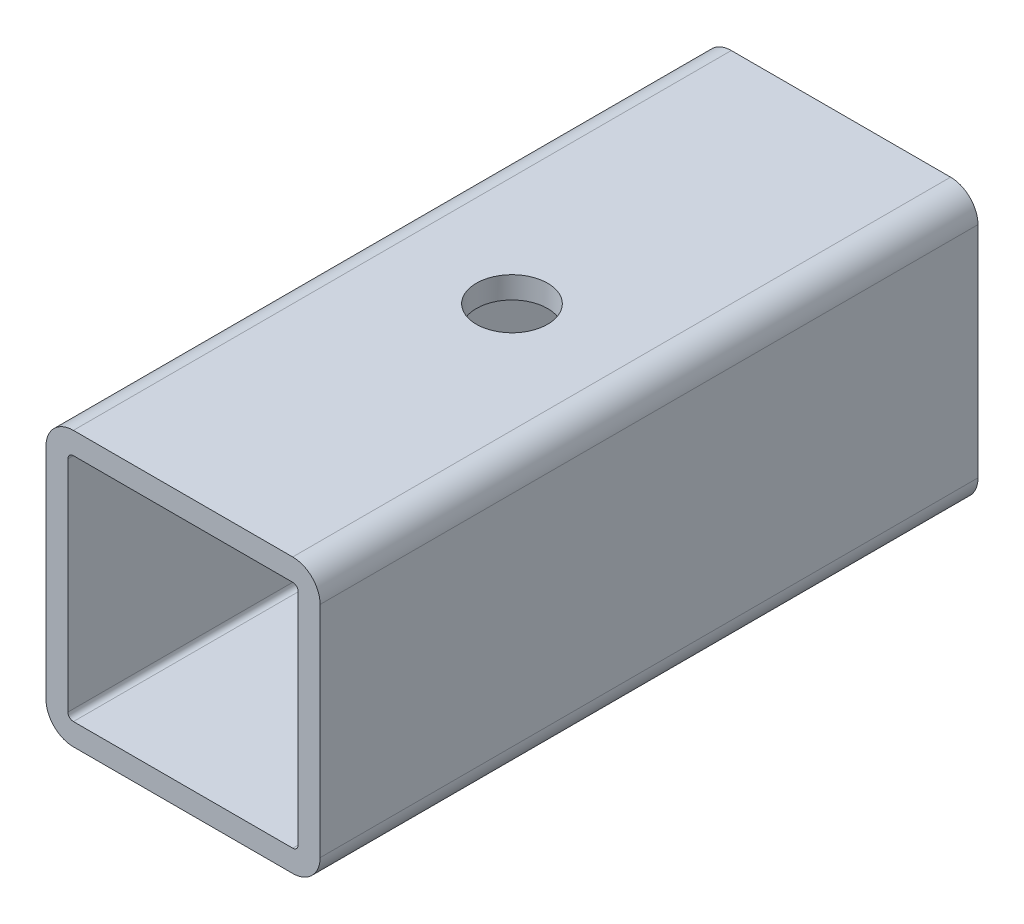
ISO-10303-21;
HEADER;
FILE_DESCRIPTION(('STEP AP214'),'2;1');
FILE_NAME('part.step','',(''),(''),'','','');
FILE_SCHEMA(('AUTOMOTIVE_DESIGN { 1 0 10303 214 1 1 1 1 }'));
ENDSEC;
DATA;
#1=APPLICATION_CONTEXT('core data for automotive mechanical design processes');
#2=APPLICATION_PROTOCOL_DEFINITION('international standard','automotive_design',2000,#1);
#3=PRODUCT_CONTEXT('',#1,'mechanical');
#4=PRODUCT('Part','Part','',(#3));
#5=PRODUCT_RELATED_PRODUCT_CATEGORY('part','',(#4));
#6=PRODUCT_DEFINITION_FORMATION('','',#4);
#7=PRODUCT_DEFINITION_CONTEXT('part definition',#1,'design');
#8=PRODUCT_DEFINITION('design','',#6,#7);
#9=PRODUCT_DEFINITION_SHAPE('','',#8);
#10=(LENGTH_UNIT() NAMED_UNIT(*) SI_UNIT(.MILLI.,.METRE.));
#11=(NAMED_UNIT(*) PLANE_ANGLE_UNIT() SI_UNIT($,.RADIAN.));
#12=(NAMED_UNIT(*) SI_UNIT($,.STERADIAN.) SOLID_ANGLE_UNIT());
#13=UNCERTAINTY_MEASURE_WITH_UNIT(LENGTH_MEASURE(1.E-05),#10,'distance_accuracy_value','');
#14=(GEOMETRIC_REPRESENTATION_CONTEXT(3) GLOBAL_UNCERTAINTY_ASSIGNED_CONTEXT((#13)) GLOBAL_UNIT_ASSIGNED_CONTEXT((#10,
#11,#12)) REPRESENTATION_CONTEXT('',''));
#15=CARTESIAN_POINT('',(0.,0.,0.));
#16=DIRECTION('',(0.,0.,1.));
#17=DIRECTION('',(1.,0.,0.));
#18=AXIS2_PLACEMENT_3D('',#15,#16,#17);
#19=CARTESIAN_POINT('',(45.,-5.,120.));
#20=DIRECTION('',(0.,0.,1.));
#21=DIRECTION('',(1.,0.,0.));
#22=AXIS2_PLACEMENT_3D('',#19,#20,#21);
#23=PLANE('',#22);
#24=CARTESIAN_POINT('',(45.,-5.,120.));
#25=DIRECTION('',(0.,0.,1.));
#26=DIRECTION('',(1.,0.,0.));
#27=AXIS2_PLACEMENT_3D('',#24,#25,#26);
#28=CIRCLE('',#27,5.);
#29=CARTESIAN_POINT('',(50.,-5.00000000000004,120.));
#30=VERTEX_POINT('',#29);
#31=CARTESIAN_POINT('',(45.,0.,120.));
#32=VERTEX_POINT('',#31);
#33=EDGE_CURVE('E228',#30,#32,#28,.T.);
#34=ORIENTED_EDGE('',*,*,#33,.T.);
#35=DIRECTION('',(-1.,0.,0.));
#36=VECTOR('',#35,1.);
#37=CARTESIAN_POINT('',(5.00000000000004,0.,120.));
#38=LINE('',#37,#36);
#39=CARTESIAN_POINT('',(5.00000000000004,0.,120.));
#40=VERTEX_POINT('',#39);
#41=EDGE_CURVE('E231',#32,#40,#38,.T.);
#42=ORIENTED_EDGE('',*,*,#41,.T.);
#43=CARTESIAN_POINT('',(5.,-5.,120.));
#44=DIRECTION('',(0.,0.,1.));
#45=DIRECTION('',(1.,0.,0.));
#46=AXIS2_PLACEMENT_3D('',#43,#44,#45);
#47=CIRCLE('',#46,5.);
#48=CARTESIAN_POINT('',(0.,-5.00000000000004,120.));
#49=VERTEX_POINT('',#48);
#50=EDGE_CURVE('E233',#40,#49,#47,.T.);
#51=ORIENTED_EDGE('',*,*,#50,.T.);
#52=DIRECTION('',(0.,-1.,0.));
#53=VECTOR('',#52,1.);
#54=CARTESIAN_POINT('',(0.,-5.00000000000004,120.));
#55=LINE('',#54,#53);
#56=CARTESIAN_POINT('',(0.,-45.,120.));
#57=VERTEX_POINT('',#56);
#58=EDGE_CURVE('E235',#49,#57,#55,.T.);
#59=ORIENTED_EDGE('',*,*,#58,.T.);
#60=CARTESIAN_POINT('',(5.00000000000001,-45.,120.));
#61=DIRECTION('',(0.,0.,1.));
#62=DIRECTION('',(-1.,0.,0.));
#63=AXIS2_PLACEMENT_3D('',#60,#61,#62);
#64=CIRCLE('',#63,5.);
#65=CARTESIAN_POINT('',(5.00000000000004,-50.,120.));
#66=VERTEX_POINT('',#65);
#67=EDGE_CURVE('E237',#57,#66,#64,.T.);
#68=ORIENTED_EDGE('',*,*,#67,.T.);
#69=DIRECTION('',(1.,0.,0.));
#70=VECTOR('',#69,1.);
#71=CARTESIAN_POINT('',(5.00000000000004,-50.,120.));
#72=LINE('',#71,#70);
#73=CARTESIAN_POINT('',(45.,-50.,120.));
#74=VERTEX_POINT('',#73);
#75=EDGE_CURVE('E239',#66,#74,#72,.T.);
#76=ORIENTED_EDGE('',*,*,#75,.T.);
#77=CARTESIAN_POINT('',(45.,-45.,120.));
#78=DIRECTION('',(0.,0.,1.));
#79=DIRECTION('',(1.,0.,0.));
#80=AXIS2_PLACEMENT_3D('',#77,#78,#79);
#81=CIRCLE('',#80,5.);
#82=CARTESIAN_POINT('',(50.,-45.,120.));
#83=VERTEX_POINT('',#82);
#84=EDGE_CURVE('E241',#74,#83,#81,.T.);
#85=ORIENTED_EDGE('',*,*,#84,.T.);
#86=DIRECTION('',(0.,1.,0.));
#87=VECTOR('',#86,1.);
#88=CARTESIAN_POINT('',(50.,-5.00000000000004,120.));
#89=LINE('',#88,#87);
#90=EDGE_CURVE('E243',#83,#30,#89,.T.);
#91=ORIENTED_EDGE('',*,*,#90,.T.);
#92=EDGE_LOOP('',(#34,#42,#51,#59,#68,#76,#85,#91));
#93=FACE_BOUND('',#92,.T.);
#94=DIRECTION('',(0.,-1.,0.));
#95=VECTOR('',#94,1.);
#96=CARTESIAN_POINT('',(4.,-5.00000000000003,120.));
#97=LINE('',#96,#95);
#98=CARTESIAN_POINT('',(4.,-5.00000000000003,120.));
#99=VERTEX_POINT('',#98);
#100=CARTESIAN_POINT('',(4.00000000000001,-45.,120.));
#101=VERTEX_POINT('',#100);
#102=EDGE_CURVE('E186',#99,#101,#97,.T.);
#103=ORIENTED_EDGE('',*,*,#102,.F.);
#104=CARTESIAN_POINT('',(5.,-5.,120.));
#105=DIRECTION('',(0.,0.,1.));
#106=DIRECTION('',(1.,0.,0.));
#107=AXIS2_PLACEMENT_3D('',#104,#105,#106);
#108=CIRCLE('',#107,0.999999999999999);
#109=CARTESIAN_POINT('',(5.00000000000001,-4.,120.));
#110=VERTEX_POINT('',#109);
#111=EDGE_CURVE('E159',#110,#99,#108,.T.);
#112=ORIENTED_EDGE('',*,*,#111,.F.);
#113=DIRECTION('',(-1.,0.,0.));
#114=VECTOR('',#113,1.);
#115=CARTESIAN_POINT('',(5.00000000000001,-4.,120.));
#116=LINE('',#115,#114);
#117=CARTESIAN_POINT('',(45.,-4.,120.));
#118=VERTEX_POINT('',#117);
#119=EDGE_CURVE('E198',#118,#110,#116,.T.);
#120=ORIENTED_EDGE('',*,*,#119,.F.);
#121=CARTESIAN_POINT('',(45.,-5.,120.));
#122=DIRECTION('',(0.,0.,1.));
#123=DIRECTION('',(1.,0.,0.));
#124=AXIS2_PLACEMENT_3D('',#121,#122,#123);
#125=CIRCLE('',#124,1.);
#126=CARTESIAN_POINT('',(46.,-5.00000000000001,120.));
#127=VERTEX_POINT('',#126);
#128=EDGE_CURVE('E196',#127,#118,#125,.T.);
#129=ORIENTED_EDGE('',*,*,#128,.F.);
#130=DIRECTION('',(0.,1.,0.));
#131=VECTOR('',#130,1.);
#132=CARTESIAN_POINT('',(46.,-5.00000000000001,120.));
#133=LINE('',#132,#131);
#134=CARTESIAN_POINT('',(46.,-45.,120.));
#135=VERTEX_POINT('',#134);
#136=EDGE_CURVE('E194',#135,#127,#133,.T.);
#137=ORIENTED_EDGE('',*,*,#136,.F.);
#138=CARTESIAN_POINT('',(45.,-45.,120.));
#139=DIRECTION('',(0.,0.,1.));
#140=DIRECTION('',(1.,0.,0.));
#141=AXIS2_PLACEMENT_3D('',#138,#139,#140);
#142=CIRCLE('',#141,0.999999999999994);
#143=CARTESIAN_POINT('',(45.,-46.,120.));
#144=VERTEX_POINT('',#143);
#145=EDGE_CURVE('E192',#144,#135,#142,.T.);
#146=ORIENTED_EDGE('',*,*,#145,.F.);
#147=DIRECTION('',(1.,0.,0.));
#148=VECTOR('',#147,1.);
#149=CARTESIAN_POINT('',(5.00000000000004,-46.,120.));
#150=LINE('',#149,#148);
#151=CARTESIAN_POINT('',(5.00000000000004,-46.,120.));
#152=VERTEX_POINT('',#151);
#153=EDGE_CURVE('E190',#152,#144,#150,.T.);
#154=ORIENTED_EDGE('',*,*,#153,.F.);
#155=CARTESIAN_POINT('',(5.00000000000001,-45.,120.));
#156=DIRECTION('',(0.,0.,1.));
#157=DIRECTION('',(-1.,0.,0.));
#158=AXIS2_PLACEMENT_3D('',#155,#156,#157);
#159=CIRCLE('',#158,0.999999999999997);
#160=EDGE_CURVE('E188',#101,#152,#159,.T.);
#161=ORIENTED_EDGE('',*,*,#160,.F.);
#162=EDGE_LOOP('',(#103,#112,#120,#129,#137,#146,#154,#161));
#163=FACE_BOUND('',#162,.T.);
#164=ADVANCED_FACE('F30',(#93,#163),#23,.T.);
#165=CARTESIAN_POINT('',(45.,-5.,0.));
#166=DIRECTION('',(0.,0.,1.));
#167=DIRECTION('',(1.,0.,0.));
#168=AXIS2_PLACEMENT_3D('',#165,#166,#167);
#169=PLANE('',#168);
#170=CARTESIAN_POINT('',(45.,-5.,0.));
#171=DIRECTION('',(0.,0.,1.));
#172=DIRECTION('',(1.,0.,0.));
#173=AXIS2_PLACEMENT_3D('',#170,#171,#172);
#174=CIRCLE('',#173,5.);
#175=CARTESIAN_POINT('',(50.,-5.00000000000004,0.));
#176=VERTEX_POINT('',#175);
#177=CARTESIAN_POINT('',(45.,0.,0.));
#178=VERTEX_POINT('',#177);
#179=EDGE_CURVE('E160',#176,#178,#174,.T.);
#180=ORIENTED_EDGE('',*,*,#179,.F.);
#181=DIRECTION('',(0.,1.,0.));
#182=VECTOR('',#181,1.);
#183=CARTESIAN_POINT('',(50.,-5.00000000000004,0.));
#184=LINE('',#183,#182);
#185=CARTESIAN_POINT('',(50.,-45.,0.));
#186=VERTEX_POINT('',#185);
#187=EDGE_CURVE('E226',#186,#176,#184,.T.);
#188=ORIENTED_EDGE('',*,*,#187,.F.);
#189=CARTESIAN_POINT('',(45.,-45.,0.));
#190=DIRECTION('',(0.,0.,1.));
#191=DIRECTION('',(1.,0.,0.));
#192=AXIS2_PLACEMENT_3D('',#189,#190,#191);
#193=CIRCLE('',#192,5.);
#194=CARTESIAN_POINT('',(45.,-50.,0.));
#195=VERTEX_POINT('',#194);
#196=EDGE_CURVE('E224',#195,#186,#193,.T.);
#197=ORIENTED_EDGE('',*,*,#196,.F.);
#198=DIRECTION('',(1.,0.,0.));
#199=VECTOR('',#198,1.);
#200=CARTESIAN_POINT('',(5.00000000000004,-50.,0.));
#201=LINE('',#200,#199);
#202=CARTESIAN_POINT('',(5.00000000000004,-50.,0.));
#203=VERTEX_POINT('',#202);
#204=EDGE_CURVE('E222',#203,#195,#201,.T.);
#205=ORIENTED_EDGE('',*,*,#204,.F.);
#206=CARTESIAN_POINT('',(5.00000000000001,-45.,0.));
#207=DIRECTION('',(0.,0.,1.));
#208=DIRECTION('',(-1.,0.,0.));
#209=AXIS2_PLACEMENT_3D('',#206,#207,#208);
#210=CIRCLE('',#209,5.);
#211=CARTESIAN_POINT('',(0.,-45.,0.));
#212=VERTEX_POINT('',#211);
#213=EDGE_CURVE('E220',#212,#203,#210,.T.);
#214=ORIENTED_EDGE('',*,*,#213,.F.);
#215=DIRECTION('',(0.,-1.,0.));
#216=VECTOR('',#215,1.);
#217=CARTESIAN_POINT('',(0.,-5.00000000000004,0.));
#218=LINE('',#217,#216);
#219=CARTESIAN_POINT('',(0.,-5.00000000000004,0.));
#220=VERTEX_POINT('',#219);
#221=EDGE_CURVE('E218',#220,#212,#218,.T.);
#222=ORIENTED_EDGE('',*,*,#221,.F.);
#223=CARTESIAN_POINT('',(5.,-5.,0.));
#224=DIRECTION('',(0.,0.,1.));
#225=DIRECTION('',(1.,0.,0.));
#226=AXIS2_PLACEMENT_3D('',#223,#224,#225);
#227=CIRCLE('',#226,5.);
#228=CARTESIAN_POINT('',(5.00000000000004,0.,0.));
#229=VERTEX_POINT('',#228);
#230=EDGE_CURVE('E216',#229,#220,#227,.T.);
#231=ORIENTED_EDGE('',*,*,#230,.F.);
#232=DIRECTION('',(-1.,0.,0.));
#233=VECTOR('',#232,1.);
#234=CARTESIAN_POINT('',(5.00000000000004,0.,0.));
#235=LINE('',#234,#233);
#236=EDGE_CURVE('E214',#178,#229,#235,.T.);
#237=ORIENTED_EDGE('',*,*,#236,.F.);
#238=EDGE_LOOP('',(#180,#188,#197,#205,#214,#222,#231,#237));
#239=FACE_BOUND('',#238,.T.);
#240=CARTESIAN_POINT('',(5.,-5.,0.));
#241=DIRECTION('',(0.,0.,1.));
#242=DIRECTION('',(1.,0.,0.));
#243=AXIS2_PLACEMENT_3D('',#240,#241,#242);
#244=CIRCLE('',#243,0.999999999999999);
#245=CARTESIAN_POINT('',(5.00000000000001,-4.,0.));
#246=VERTEX_POINT('',#245);
#247=CARTESIAN_POINT('',(4.,-5.00000000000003,0.));
#248=VERTEX_POINT('',#247);
#249=EDGE_CURVE('E54',#246,#248,#244,.T.);
#250=ORIENTED_EDGE('',*,*,#249,.T.);
#251=DIRECTION('',(0.,-1.,0.));
#252=VECTOR('',#251,1.);
#253=CARTESIAN_POINT('',(4.,-5.00000000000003,0.));
#254=LINE('',#253,#252);
#255=CARTESIAN_POINT('',(4.00000000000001,-45.,0.));
#256=VERTEX_POINT('',#255);
#257=EDGE_CURVE('E146',#248,#256,#254,.T.);
#258=ORIENTED_EDGE('',*,*,#257,.T.);
#259=CARTESIAN_POINT('',(5.00000000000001,-45.,0.));
#260=DIRECTION('',(0.,0.,1.));
#261=DIRECTION('',(-1.,0.,0.));
#262=AXIS2_PLACEMENT_3D('',#259,#260,#261);
#263=CIRCLE('',#262,0.999999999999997);
#264=CARTESIAN_POINT('',(5.00000000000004,-46.,0.));
#265=VERTEX_POINT('',#264);
#266=EDGE_CURVE('E155',#256,#265,#263,.T.);
#267=ORIENTED_EDGE('',*,*,#266,.T.);
#268=DIRECTION('',(1.,0.,0.));
#269=VECTOR('',#268,1.);
#270=CARTESIAN_POINT('',(5.00000000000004,-46.,0.));
#271=LINE('',#270,#269);
#272=CARTESIAN_POINT('',(45.,-46.,0.));
#273=VERTEX_POINT('',#272);
#274=EDGE_CURVE('E173',#265,#273,#271,.T.);
#275=ORIENTED_EDGE('',*,*,#274,.T.);
#276=CARTESIAN_POINT('',(45.,-45.,0.));
#277=DIRECTION('',(0.,0.,1.));
#278=DIRECTION('',(1.,0.,0.));
#279=AXIS2_PLACEMENT_3D('',#276,#277,#278);
#280=CIRCLE('',#279,0.999999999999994);
#281=CARTESIAN_POINT('',(46.,-45.,0.));
#282=VERTEX_POINT('',#281);
#283=EDGE_CURVE('E176',#273,#282,#280,.T.);
#284=ORIENTED_EDGE('',*,*,#283,.T.);
#285=DIRECTION('',(0.,1.,0.));
#286=VECTOR('',#285,1.);
#287=CARTESIAN_POINT('',(46.,-5.00000000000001,0.));
#288=LINE('',#287,#286);
#289=CARTESIAN_POINT('',(46.,-5.00000000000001,0.));
#290=VERTEX_POINT('',#289);
#291=EDGE_CURVE('E179',#282,#290,#288,.T.);
#292=ORIENTED_EDGE('',*,*,#291,.T.);
#293=CARTESIAN_POINT('',(45.,-5.,0.));
#294=DIRECTION('',(0.,0.,1.));
#295=DIRECTION('',(1.,0.,0.));
#296=AXIS2_PLACEMENT_3D('',#293,#294,#295);
#297=CIRCLE('',#296,1.);
#298=CARTESIAN_POINT('',(45.,-4.,0.));
#299=VERTEX_POINT('',#298);
#300=EDGE_CURVE('E182',#290,#299,#297,.T.);
#301=ORIENTED_EDGE('',*,*,#300,.T.);
#302=DIRECTION('',(-1.,0.,0.));
#303=VECTOR('',#302,1.);
#304=CARTESIAN_POINT('',(5.00000000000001,-4.,0.));
#305=LINE('',#304,#303);
#306=EDGE_CURVE('E165',#299,#246,#305,.T.);
#307=ORIENTED_EDGE('',*,*,#306,.T.);
#308=EDGE_LOOP('',(#250,#258,#267,#275,#284,#292,#301,#307));
#309=FACE_BOUND('',#308,.T.);
#310=ADVANCED_FACE('F163',(#239,#309),#169,.F.);
#311=CARTESIAN_POINT('',(45.,-5.,120.));
#312=DIRECTION('',(0.,0.,-1.));
#313=DIRECTION('',(-1.,0.,0.));
#314=AXIS2_PLACEMENT_3D('',#311,#312,#313);
#315=CYLINDRICAL_SURFACE('',#314,5.);
#316=ORIENTED_EDGE('',*,*,#179,.T.);
#317=DIRECTION('',(0.,0.,-1.));
#318=VECTOR('',#317,1.);
#319=CARTESIAN_POINT('',(45.,0.,120.));
#320=LINE('',#319,#318);
#321=EDGE_CURVE('E11',#32,#178,#320,.T.);
#322=ORIENTED_EDGE('',*,*,#321,.F.);
#323=ORIENTED_EDGE('',*,*,#33,.F.);
#324=DIRECTION('',(0.,0.,-1.));
#325=VECTOR('',#324,1.);
#326=CARTESIAN_POINT('',(50.,-5.00000000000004,120.));
#327=LINE('',#326,#325);
#328=EDGE_CURVE('E245',#30,#176,#327,.T.);
#329=ORIENTED_EDGE('',*,*,#328,.T.);
#330=EDGE_LOOP('',(#316,#322,#323,#329));
#331=FACE_BOUND('',#330,.T.);
#332=ADVANCED_FACE('F32',(#331),#315,.T.);
#333=CARTESIAN_POINT('',(5.00000000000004,0.,120.));
#334=DIRECTION('',(0.,-1.,0.));
#335=DIRECTION('',(0.,0.,-1.));
#336=AXIS2_PLACEMENT_3D('',#333,#334,#335);
#337=PLANE('',#336);
#338=CARTESIAN_POINT('',(25.,0.,60.));
#339=DIRECTION('',(0.,1.,0.));
#340=DIRECTION('',(0.,0.,1.));
#341=AXIS2_PLACEMENT_3D('',#338,#339,#340);
#342=CIRCLE('',#341,6.5);
#343=CARTESIAN_POINT('',(25.,0.,66.5));
#344=VERTEX_POINT('',#343);
#345=EDGE_CURVE('E368',#344,#344,#342,.T.);
#346=ORIENTED_EDGE('',*,*,#345,.F.);
#347=EDGE_LOOP('',(#346));
#348=FACE_BOUND('',#347,.T.);
#349=ORIENTED_EDGE('',*,*,#236,.T.);
#350=DIRECTION('',(0.,0.,-1.));
#351=VECTOR('',#350,1.);
#352=CARTESIAN_POINT('',(5.00000000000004,0.,120.));
#353=LINE('',#352,#351);
#354=EDGE_CURVE('E39',#40,#229,#353,.T.);
#355=ORIENTED_EDGE('',*,*,#354,.F.);
#356=ORIENTED_EDGE('',*,*,#41,.F.);
#357=ORIENTED_EDGE('',*,*,#321,.T.);
#358=EDGE_LOOP('',(#349,#355,#356,#357));
#359=FACE_BOUND('',#358,.T.);
#360=ADVANCED_FACE('F290',(#348,#359),#337,.F.);
#361=CARTESIAN_POINT('',(5.,-5.,120.));
#362=DIRECTION('',(0.,0.,-1.));
#363=DIRECTION('',(-1.,0.,0.));
#364=AXIS2_PLACEMENT_3D('',#361,#362,#363);
#365=CYLINDRICAL_SURFACE('',#364,5.);
#366=ORIENTED_EDGE('',*,*,#230,.T.);
#367=DIRECTION('',(0.,0.,-1.));
#368=VECTOR('',#367,1.);
#369=CARTESIAN_POINT('',(0.,-5.00000000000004,120.));
#370=LINE('',#369,#368);
#371=EDGE_CURVE('E260',#49,#220,#370,.T.);
#372=ORIENTED_EDGE('',*,*,#371,.F.);
#373=ORIENTED_EDGE('',*,*,#50,.F.);
#374=ORIENTED_EDGE('',*,*,#354,.T.);
#375=EDGE_LOOP('',(#366,#372,#373,#374));
#376=FACE_BOUND('',#375,.T.);
#377=ADVANCED_FACE('F268',(#376),#365,.T.);
#378=CARTESIAN_POINT('',(0.,-5.00000000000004,120.));
#379=DIRECTION('',(1.,0.,0.));
#380=DIRECTION('',(0.,1.,0.));
#381=AXIS2_PLACEMENT_3D('',#378,#379,#380);
#382=PLANE('',#381);
#383=ORIENTED_EDGE('',*,*,#221,.T.);
#384=DIRECTION('',(0.,0.,-1.));
#385=VECTOR('',#384,1.);
#386=CARTESIAN_POINT('',(0.,-45.,120.));
#387=LINE('',#386,#385);
#388=EDGE_CURVE('E257',#57,#212,#387,.T.);
#389=ORIENTED_EDGE('',*,*,#388,.F.);
#390=ORIENTED_EDGE('',*,*,#58,.F.);
#391=ORIENTED_EDGE('',*,*,#371,.T.);
#392=EDGE_LOOP('',(#383,#389,#390,#391));
#393=FACE_BOUND('',#392,.T.);
#394=ADVANCED_FACE('F278',(#393),#382,.F.);
#395=CARTESIAN_POINT('',(5.00000000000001,-45.,120.));
#396=DIRECTION('',(0.,0.,-1.));
#397=DIRECTION('',(-1.,0.,0.));
#398=AXIS2_PLACEMENT_3D('',#395,#396,#397);
#399=CYLINDRICAL_SURFACE('',#398,5.);
#400=ORIENTED_EDGE('',*,*,#213,.T.);
#401=DIRECTION('',(0.,0.,-1.));
#402=VECTOR('',#401,1.);
#403=CARTESIAN_POINT('',(5.00000000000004,-50.,120.));
#404=LINE('',#403,#402);
#405=EDGE_CURVE('E254',#66,#203,#404,.T.);
#406=ORIENTED_EDGE('',*,*,#405,.F.);
#407=ORIENTED_EDGE('',*,*,#67,.F.);
#408=ORIENTED_EDGE('',*,*,#388,.T.);
#409=EDGE_LOOP('',(#400,#406,#407,#408));
#410=FACE_BOUND('',#409,.T.);
#411=ADVANCED_FACE('F282',(#410),#399,.T.);
#412=CARTESIAN_POINT('',(5.00000000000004,-50.,120.));
#413=DIRECTION('',(0.,1.,0.));
#414=DIRECTION('',(0.,0.,1.));
#415=AXIS2_PLACEMENT_3D('',#412,#413,#414);
#416=PLANE('',#415);
#417=CARTESIAN_POINT('',(25.,-50.,60.));
#418=DIRECTION('',(0.,1.,0.));
#419=DIRECTION('',(0.,0.,1.));
#420=AXIS2_PLACEMENT_3D('',#417,#418,#419);
#421=CIRCLE('',#420,6.5);
#422=CARTESIAN_POINT('',(25.,-50.,66.5));
#423=VERTEX_POINT('',#422);
#424=EDGE_CURVE('E370',#423,#423,#421,.T.);
#425=ORIENTED_EDGE('',*,*,#424,.T.);
#426=EDGE_LOOP('',(#425));
#427=FACE_BOUND('',#426,.T.);
#428=ORIENTED_EDGE('',*,*,#204,.T.);
#429=DIRECTION('',(0.,0.,-1.));
#430=VECTOR('',#429,1.);
#431=CARTESIAN_POINT('',(45.,-50.,120.));
#432=LINE('',#431,#430);
#433=EDGE_CURVE('E251',#74,#195,#432,.T.);
#434=ORIENTED_EDGE('',*,*,#433,.F.);
#435=ORIENTED_EDGE('',*,*,#75,.F.);
#436=ORIENTED_EDGE('',*,*,#405,.T.);
#437=EDGE_LOOP('',(#428,#434,#435,#436));
#438=FACE_BOUND('',#437,.T.);
#439=ADVANCED_FACE('F303',(#427,#438),#416,.F.);
#440=CARTESIAN_POINT('',(45.,-45.,120.));
#441=DIRECTION('',(0.,0.,-1.));
#442=DIRECTION('',(-1.,0.,0.));
#443=AXIS2_PLACEMENT_3D('',#440,#441,#442);
#444=CYLINDRICAL_SURFACE('',#443,5.);
#445=ORIENTED_EDGE('',*,*,#196,.T.);
#446=DIRECTION('',(0.,0.,-1.));
#447=VECTOR('',#446,1.);
#448=CARTESIAN_POINT('',(50.,-45.,120.));
#449=LINE('',#448,#447);
#450=EDGE_CURVE('E248',#83,#186,#449,.T.);
#451=ORIENTED_EDGE('',*,*,#450,.F.);
#452=ORIENTED_EDGE('',*,*,#84,.F.);
#453=ORIENTED_EDGE('',*,*,#433,.T.);
#454=EDGE_LOOP('',(#445,#451,#452,#453));
#455=FACE_BOUND('',#454,.T.);
#456=ADVANCED_FACE('F301',(#455),#444,.T.);
#457=CARTESIAN_POINT('',(50.,-5.00000000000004,120.));
#458=DIRECTION('',(-1.,0.,0.));
#459=DIRECTION('',(0.,-1.,0.));
#460=AXIS2_PLACEMENT_3D('',#457,#458,#459);
#461=PLANE('',#460);
#462=ORIENTED_EDGE('',*,*,#187,.T.);
#463=ORIENTED_EDGE('',*,*,#328,.F.);
#464=ORIENTED_EDGE('',*,*,#90,.F.);
#465=ORIENTED_EDGE('',*,*,#450,.T.);
#466=EDGE_LOOP('',(#462,#463,#464,#465));
#467=FACE_BOUND('',#466,.T.);
#468=ADVANCED_FACE('F296',(#467),#461,.F.);
#469=CARTESIAN_POINT('',(5.,-5.,120.));
#470=DIRECTION('',(0.,0.,-1.));
#471=DIRECTION('',(-1.,0.,0.));
#472=AXIS2_PLACEMENT_3D('',#469,#470,#471);
#473=CYLINDRICAL_SURFACE('',#472,0.999999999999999);
#474=ORIENTED_EDGE('',*,*,#249,.F.);
#475=DIRECTION('',(0.,0.,-1.));
#476=VECTOR('',#475,1.);
#477=CARTESIAN_POINT('',(5.00000000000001,-4.,120.));
#478=LINE('',#477,#476);
#479=EDGE_CURVE('E200',#110,#246,#478,.T.);
#480=ORIENTED_EDGE('',*,*,#479,.F.);
#481=ORIENTED_EDGE('',*,*,#111,.T.);
#482=DIRECTION('',(0.,0.,-1.));
#483=VECTOR('',#482,1.);
#484=CARTESIAN_POINT('',(4.,-5.00000000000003,120.));
#485=LINE('',#484,#483);
#486=EDGE_CURVE('E148',#99,#248,#485,.T.);
#487=ORIENTED_EDGE('',*,*,#486,.T.);
#488=EDGE_LOOP('',(#474,#480,#481,#487));
#489=FACE_BOUND('',#488,.T.);
#490=ADVANCED_FACE('F157',(#489),#473,.F.);
#491=CARTESIAN_POINT('',(4.,-5.00000000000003,120.));
#492=DIRECTION('',(1.,0.,0.));
#493=DIRECTION('',(0.,1.,0.));
#494=AXIS2_PLACEMENT_3D('',#491,#492,#493);
#495=PLANE('',#494);
#496=ORIENTED_EDGE('',*,*,#257,.F.);
#497=ORIENTED_EDGE('',*,*,#486,.F.);
#498=ORIENTED_EDGE('',*,*,#102,.T.);
#499=DIRECTION('',(0.,0.,-1.));
#500=VECTOR('',#499,1.);
#501=CARTESIAN_POINT('',(4.00000000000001,-45.,120.));
#502=LINE('',#501,#500);
#503=EDGE_CURVE('E151',#101,#256,#502,.T.);
#504=ORIENTED_EDGE('',*,*,#503,.T.);
#505=EDGE_LOOP('',(#496,#497,#498,#504));
#506=FACE_BOUND('',#505,.T.);
#507=ADVANCED_FACE('F147',(#506),#495,.T.);
#508=CARTESIAN_POINT('',(5.00000000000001,-45.,120.));
#509=DIRECTION('',(0.,0.,-1.));
#510=DIRECTION('',(-1.,0.,0.));
#511=AXIS2_PLACEMENT_3D('',#508,#509,#510);
#512=CYLINDRICAL_SURFACE('',#511,0.999999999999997);
#513=ORIENTED_EDGE('',*,*,#266,.F.);
#514=ORIENTED_EDGE('',*,*,#503,.F.);
#515=ORIENTED_EDGE('',*,*,#160,.T.);
#516=DIRECTION('',(0.,0.,-1.));
#517=VECTOR('',#516,1.);
#518=CARTESIAN_POINT('',(5.00000000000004,-46.,120.));
#519=LINE('',#518,#517);
#520=EDGE_CURVE('E209',#152,#265,#519,.T.);
#521=ORIENTED_EDGE('',*,*,#520,.T.);
#522=EDGE_LOOP('',(#513,#514,#515,#521));
#523=FACE_BOUND('',#522,.T.);
#524=ADVANCED_FACE('F329',(#523),#512,.F.);
#525=CARTESIAN_POINT('',(5.00000000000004,-46.,120.));
#526=DIRECTION('',(0.,1.,0.));
#527=DIRECTION('',(0.,0.,1.));
#528=AXIS2_PLACEMENT_3D('',#525,#526,#527);
#529=PLANE('',#528);
#530=CARTESIAN_POINT('',(25.,-46.,60.));
#531=DIRECTION('',(0.,1.,0.));
#532=DIRECTION('',(0.,0.,1.));
#533=AXIS2_PLACEMENT_3D('',#530,#531,#532);
#534=CIRCLE('',#533,6.5);
#535=CARTESIAN_POINT('',(25.,-46.,66.5));
#536=VERTEX_POINT('',#535);
#537=EDGE_CURVE('E166',#536,#536,#534,.T.);
#538=ORIENTED_EDGE('',*,*,#537,.F.);
#539=EDGE_LOOP('',(#538));
#540=FACE_BOUND('',#539,.T.);
#541=ORIENTED_EDGE('',*,*,#274,.F.);
#542=ORIENTED_EDGE('',*,*,#520,.F.);
#543=ORIENTED_EDGE('',*,*,#153,.T.);
#544=DIRECTION('',(0.,0.,-1.));
#545=VECTOR('',#544,1.);
#546=CARTESIAN_POINT('',(45.,-46.,120.));
#547=LINE('',#546,#545);
#548=EDGE_CURVE('E207',#144,#273,#547,.T.);
#549=ORIENTED_EDGE('',*,*,#548,.T.);
#550=EDGE_LOOP('',(#541,#542,#543,#549));
#551=FACE_BOUND('',#550,.T.);
#552=ADVANCED_FACE('F334',(#540,#551),#529,.T.);
#553=CARTESIAN_POINT('',(45.,-45.,120.));
#554=DIRECTION('',(0.,0.,-1.));
#555=DIRECTION('',(-1.,0.,0.));
#556=AXIS2_PLACEMENT_3D('',#553,#554,#555);
#557=CYLINDRICAL_SURFACE('',#556,0.999999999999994);
#558=ORIENTED_EDGE('',*,*,#283,.F.);
#559=ORIENTED_EDGE('',*,*,#548,.F.);
#560=ORIENTED_EDGE('',*,*,#145,.T.);
#561=DIRECTION('',(0.,0.,-1.));
#562=VECTOR('',#561,1.);
#563=CARTESIAN_POINT('',(46.,-45.,120.));
#564=LINE('',#563,#562);
#565=EDGE_CURVE('E205',#135,#282,#564,.T.);
#566=ORIENTED_EDGE('',*,*,#565,.T.);
#567=EDGE_LOOP('',(#558,#559,#560,#566));
#568=FACE_BOUND('',#567,.T.);
#569=ADVANCED_FACE('F338',(#568),#557,.F.);
#570=CARTESIAN_POINT('',(46.,-5.00000000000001,120.));
#571=DIRECTION('',(-1.,0.,0.));
#572=DIRECTION('',(0.,0.,1.));
#573=AXIS2_PLACEMENT_3D('',#570,#571,#572);
#574=PLANE('',#573);
#575=ORIENTED_EDGE('',*,*,#291,.F.);
#576=ORIENTED_EDGE('',*,*,#565,.F.);
#577=ORIENTED_EDGE('',*,*,#136,.T.);
#578=DIRECTION('',(0.,0.,-1.));
#579=VECTOR('',#578,1.);
#580=CARTESIAN_POINT('',(46.,-5.00000000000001,120.));
#581=LINE('',#580,#579);
#582=EDGE_CURVE('E203',#127,#290,#581,.T.);
#583=ORIENTED_EDGE('',*,*,#582,.T.);
#584=EDGE_LOOP('',(#575,#576,#577,#583));
#585=FACE_BOUND('',#584,.T.);
#586=ADVANCED_FACE('F342',(#585),#574,.T.);
#587=CARTESIAN_POINT('',(45.,-5.,120.));
#588=DIRECTION('',(0.,0.,-1.));
#589=DIRECTION('',(-1.,0.,0.));
#590=AXIS2_PLACEMENT_3D('',#587,#588,#589);
#591=CYLINDRICAL_SURFACE('',#590,1.);
#592=ORIENTED_EDGE('',*,*,#300,.F.);
#593=ORIENTED_EDGE('',*,*,#582,.F.);
#594=ORIENTED_EDGE('',*,*,#128,.T.);
#595=DIRECTION('',(0.,0.,-1.));
#596=VECTOR('',#595,1.);
#597=CARTESIAN_POINT('',(45.,-4.,120.));
#598=LINE('',#597,#596);
#599=EDGE_CURVE('E46',#118,#299,#598,.T.);
#600=ORIENTED_EDGE('',*,*,#599,.T.);
#601=EDGE_LOOP('',(#592,#593,#594,#600));
#602=FACE_BOUND('',#601,.T.);
#603=ADVANCED_FACE('F346',(#602),#591,.F.);
#604=CARTESIAN_POINT('',(5.00000000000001,-4.,120.));
#605=DIRECTION('',(0.,-1.,0.));
#606=DIRECTION('',(0.,0.,-1.));
#607=AXIS2_PLACEMENT_3D('',#604,#605,#606);
#608=PLANE('',#607);
#609=CARTESIAN_POINT('',(25.,-4.,60.));
#610=DIRECTION('',(0.,-1.,0.));
#611=DIRECTION('',(0.,0.,-1.));
#612=AXIS2_PLACEMENT_3D('',#609,#610,#611);
#613=CIRCLE('',#612,6.5);
#614=CARTESIAN_POINT('',(25.,-4.,53.5));
#615=VERTEX_POINT('',#614);
#616=EDGE_CURVE('E34',#615,#615,#613,.T.);
#617=ORIENTED_EDGE('',*,*,#616,.F.);
#618=EDGE_LOOP('',(#617));
#619=FACE_BOUND('',#618,.T.);
#620=ORIENTED_EDGE('',*,*,#306,.F.);
#621=ORIENTED_EDGE('',*,*,#599,.F.);
#622=ORIENTED_EDGE('',*,*,#119,.T.);
#623=ORIENTED_EDGE('',*,*,#479,.T.);
#624=EDGE_LOOP('',(#620,#621,#622,#623));
#625=FACE_BOUND('',#624,.T.);
#626=ADVANCED_FACE('F350',(#619,#625),#608,.T.);
#627=CARTESIAN_POINT('',(25.,-50.,60.));
#628=DIRECTION('',(0.,1.,0.));
#629=DIRECTION('',(0.,0.,1.));
#630=AXIS2_PLACEMENT_3D('',#627,#628,#629);
#631=CYLINDRICAL_SURFACE('',#630,6.5);
#632=ORIENTED_EDGE('',*,*,#616,.T.);
#633=EDGE_LOOP('',(#632));
#634=FACE_BOUND('',#633,.T.);
#635=ORIENTED_EDGE('',*,*,#345,.T.);
#636=EDGE_LOOP('',(#635));
#637=FACE_BOUND('',#636,.T.);
#638=ADVANCED_FACE('F354',(#634,#637),#631,.F.);
#639=ORIENTED_EDGE('',*,*,#537,.T.);
#640=EDGE_LOOP('',(#639));
#641=FACE_BOUND('',#640,.T.);
#642=ORIENTED_EDGE('',*,*,#424,.F.);
#643=EDGE_LOOP('',(#642));
#644=FACE_BOUND('',#643,.T.);
#645=ADVANCED_FACE('F357',(#641,#644),#631,.F.);
#646=CLOSED_SHELL('',(#164,#310,#332,#360,#377,#394,#411,#439,#456,#468,#490,#507,#524,#552,
#569,#586,#603,#626,#638,#645));
#647=MANIFOLD_SOLID_BREP('B2',#646);
#648=ADVANCED_BREP_SHAPE_REPRESENTATION('',(#18,#647),#14);
#649=SHAPE_DEFINITION_REPRESENTATION(#9,#648);
ENDSEC;
END-ISO-10303-21;
